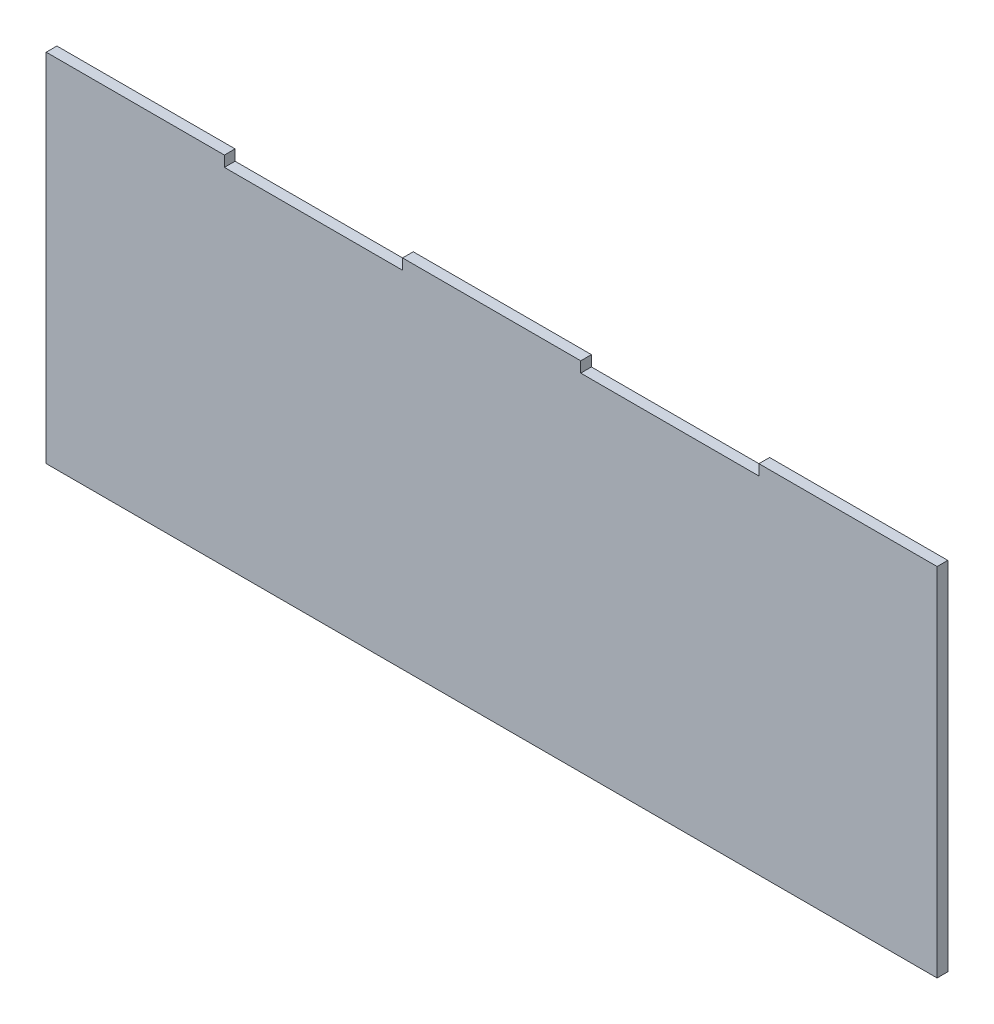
ISO-10303-21;
HEADER;
FILE_DESCRIPTION(('STEP AP214'),'2;1');
FILE_NAME('part.step','',(''),(''),'','','');
FILE_SCHEMA(('AUTOMOTIVE_DESIGN { 1 0 10303 214 1 1 1 1 }'));
ENDSEC;
DATA;
#1=APPLICATION_CONTEXT('core data for automotive mechanical design processes');
#2=APPLICATION_PROTOCOL_DEFINITION('international standard','automotive_design',2000,#1);
#3=PRODUCT_CONTEXT('',#1,'mechanical');
#4=PRODUCT('Part','Part','',(#3));
#5=PRODUCT_RELATED_PRODUCT_CATEGORY('part','',(#4));
#6=PRODUCT_DEFINITION_FORMATION('','',#4);
#7=PRODUCT_DEFINITION_CONTEXT('part definition',#1,'design');
#8=PRODUCT_DEFINITION('design','',#6,#7);
#9=PRODUCT_DEFINITION_SHAPE('','',#8);
#10=(LENGTH_UNIT() NAMED_UNIT(*) SI_UNIT(.MILLI.,.METRE.));
#11=(NAMED_UNIT(*) PLANE_ANGLE_UNIT() SI_UNIT($,.RADIAN.));
#12=(NAMED_UNIT(*) SI_UNIT($,.STERADIAN.) SOLID_ANGLE_UNIT());
#13=UNCERTAINTY_MEASURE_WITH_UNIT(LENGTH_MEASURE(1.E-05),#10,'distance_accuracy_value','');
#14=(GEOMETRIC_REPRESENTATION_CONTEXT(3) GLOBAL_UNCERTAINTY_ASSIGNED_CONTEXT((#13)) GLOBAL_UNIT_ASSIGNED_CONTEXT((#10,
#11,#12)) REPRESENTATION_CONTEXT('',''));
#15=CARTESIAN_POINT('',(0.,0.,0.));
#16=DIRECTION('',(0.,0.,1.));
#17=DIRECTION('',(1.,0.,0.));
#18=AXIS2_PLACEMENT_3D('',#15,#16,#17);
#19=CARTESIAN_POINT('',(5.99315068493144,214.041095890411,6.));
#20=DIRECTION('',(-1.,0.,0.));
#21=DIRECTION('',(0.,-1.,0.));
#22=AXIS2_PLACEMENT_3D('',#19,#20,#21);
#23=PLANE('',#22);
#24=DIRECTION('',(0.,1.,0.));
#25=VECTOR('',#24,1.);
#26=CARTESIAN_POINT('',(5.99315068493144,214.041095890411,0.));
#27=LINE('',#26,#25);
#28=CARTESIAN_POINT('',(5.99315068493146,14.0410958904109,0.));
#29=VERTEX_POINT('',#28);
#30=CARTESIAN_POINT('',(5.99315068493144,214.041095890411,0.));
#31=VERTEX_POINT('',#30);
#32=EDGE_CURVE('E153',#29,#31,#27,.T.);
#33=ORIENTED_EDGE('',*,*,#32,.T.);
#34=DIRECTION('',(0.,0.,-1.));
#35=VECTOR('',#34,1.);
#36=CARTESIAN_POINT('',(5.99315068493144,214.041095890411,6.));
#37=LINE('',#36,#35);
#38=CARTESIAN_POINT('',(5.99315068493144,214.041095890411,6.));
#39=VERTEX_POINT('',#38);
#40=EDGE_CURVE('E11',#39,#31,#37,.T.);
#41=ORIENTED_EDGE('',*,*,#40,.F.);
#42=DIRECTION('',(0.,1.,0.));
#43=VECTOR('',#42,1.);
#44=CARTESIAN_POINT('',(5.99315068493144,214.041095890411,6.));
#45=LINE('',#44,#43);
#46=CARTESIAN_POINT('',(5.99315068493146,14.0410958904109,6.));
#47=VERTEX_POINT('',#46);
#48=EDGE_CURVE('E175',#47,#39,#45,.T.);
#49=ORIENTED_EDGE('',*,*,#48,.F.);
#50=DIRECTION('',(0.,0.,-1.));
#51=VECTOR('',#50,1.);
#52=CARTESIAN_POINT('',(5.99315068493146,14.0410958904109,6.));
#53=LINE('',#52,#51);
#54=EDGE_CURVE('E149',#47,#29,#53,.T.);
#55=ORIENTED_EDGE('',*,*,#54,.T.);
#56=EDGE_LOOP('',(#33,#41,#49,#55));
#57=FACE_BOUND('',#56,.T.);
#58=ADVANCED_FACE('F33',(#57),#23,.F.);
#59=CARTESIAN_POINT('',(-94.0068493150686,214.041095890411,6.));
#60=DIRECTION('',(0.,-1.,0.));
#61=DIRECTION('',(0.,0.,-1.));
#62=AXIS2_PLACEMENT_3D('',#59,#60,#61);
#63=PLANE('',#62);
#64=DIRECTION('',(-1.,0.,0.));
#65=VECTOR('',#64,1.);
#66=CARTESIAN_POINT('',(-94.0068493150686,214.041095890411,0.));
#67=LINE('',#66,#65);
#68=CARTESIAN_POINT('',(-94.0068493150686,214.041095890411,0.));
#69=VERTEX_POINT('',#68);
#70=EDGE_CURVE('E156',#31,#69,#67,.T.);
#71=ORIENTED_EDGE('',*,*,#70,.T.);
#72=DIRECTION('',(0.,0.,-1.));
#73=VECTOR('',#72,1.);
#74=CARTESIAN_POINT('',(-94.0068493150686,214.041095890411,6.));
#75=LINE('',#74,#73);
#76=CARTESIAN_POINT('',(-94.0068493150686,214.041095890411,6.));
#77=VERTEX_POINT('',#76);
#78=EDGE_CURVE('E41',#77,#69,#75,.T.);
#79=ORIENTED_EDGE('',*,*,#78,.F.);
#80=DIRECTION('',(-1.,0.,0.));
#81=VECTOR('',#80,1.);
#82=CARTESIAN_POINT('',(-94.0068493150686,214.041095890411,6.));
#83=LINE('',#82,#81);
#84=EDGE_CURVE('E104',#39,#77,#83,.T.);
#85=ORIENTED_EDGE('',*,*,#84,.F.);
#86=ORIENTED_EDGE('',*,*,#40,.T.);
#87=EDGE_LOOP('',(#71,#79,#85,#86));
#88=FACE_BOUND('',#87,.T.);
#89=ADVANCED_FACE('F253',(#88),#63,.F.);
#90=CARTESIAN_POINT('',(-94.0068493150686,214.041095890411,6.));
#91=DIRECTION('',(1.,0.,0.));
#92=DIRECTION('',(0.,0.,-1.));
#93=AXIS2_PLACEMENT_3D('',#90,#91,#92);
#94=PLANE('',#93);
#95=DIRECTION('',(0.,-1.,0.));
#96=VECTOR('',#95,1.);
#97=CARTESIAN_POINT('',(-94.0068493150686,214.041095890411,0.));
#98=LINE('',#97,#96);
#99=CARTESIAN_POINT('',(-94.0068493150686,208.041095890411,0.));
#100=VERTEX_POINT('',#99);
#101=EDGE_CURVE('E158',#69,#100,#98,.T.);
#102=ORIENTED_EDGE('',*,*,#101,.T.);
#103=DIRECTION('',(0.,0.,-1.));
#104=VECTOR('',#103,1.);
#105=CARTESIAN_POINT('',(-94.0068493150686,208.041095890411,6.));
#106=LINE('',#105,#104);
#107=CARTESIAN_POINT('',(-94.0068493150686,208.041095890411,6.));
#108=VERTEX_POINT('',#107);
#109=EDGE_CURVE('E194',#108,#100,#106,.T.);
#110=ORIENTED_EDGE('',*,*,#109,.F.);
#111=DIRECTION('',(0.,-1.,0.));
#112=VECTOR('',#111,1.);
#113=CARTESIAN_POINT('',(-94.0068493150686,214.041095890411,6.));
#114=LINE('',#113,#112);
#115=EDGE_CURVE('E202',#77,#108,#114,.T.);
#116=ORIENTED_EDGE('',*,*,#115,.F.);
#117=ORIENTED_EDGE('',*,*,#78,.T.);
#118=EDGE_LOOP('',(#102,#110,#116,#117));
#119=FACE_BOUND('',#118,.T.);
#120=ADVANCED_FACE('F200',(#119),#94,.F.);
#121=CARTESIAN_POINT('',(-194.006849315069,208.041095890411,6.));
#122=DIRECTION('',(0.,-1.,0.));
#123=DIRECTION('',(0.,0.,-1.));
#124=AXIS2_PLACEMENT_3D('',#121,#122,#123);
#125=PLANE('',#124);
#126=DIRECTION('',(-1.,0.,0.));
#127=VECTOR('',#126,1.);
#128=CARTESIAN_POINT('',(-194.006849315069,208.041095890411,0.));
#129=LINE('',#128,#127);
#130=CARTESIAN_POINT('',(-194.006849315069,208.041095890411,0.));
#131=VERTEX_POINT('',#130);
#132=EDGE_CURVE('E160',#100,#131,#129,.T.);
#133=ORIENTED_EDGE('',*,*,#132,.T.);
#134=DIRECTION('',(0.,0.,-1.));
#135=VECTOR('',#134,1.);
#136=CARTESIAN_POINT('',(-194.006849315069,208.041095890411,6.));
#137=LINE('',#136,#135);
#138=CARTESIAN_POINT('',(-194.006849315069,208.041095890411,6.));
#139=VERTEX_POINT('',#138);
#140=EDGE_CURVE('E191',#139,#131,#137,.T.);
#141=ORIENTED_EDGE('',*,*,#140,.F.);
#142=DIRECTION('',(-1.,0.,0.));
#143=VECTOR('',#142,1.);
#144=CARTESIAN_POINT('',(-194.006849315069,208.041095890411,6.));
#145=LINE('',#144,#143);
#146=EDGE_CURVE('E220',#108,#139,#145,.T.);
#147=ORIENTED_EDGE('',*,*,#146,.F.);
#148=ORIENTED_EDGE('',*,*,#109,.T.);
#149=EDGE_LOOP('',(#133,#141,#147,#148));
#150=FACE_BOUND('',#149,.T.);
#151=ADVANCED_FACE('F211',(#150),#125,.F.);
#152=CARTESIAN_POINT('',(-194.006849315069,214.041095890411,6.));
#153=DIRECTION('',(-1.,0.,0.));
#154=DIRECTION('',(0.,-1.,0.));
#155=AXIS2_PLACEMENT_3D('',#152,#153,#154);
#156=PLANE('',#155);
#157=DIRECTION('',(0.,1.,0.));
#158=VECTOR('',#157,1.);
#159=CARTESIAN_POINT('',(-194.006849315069,214.041095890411,0.));
#160=LINE('',#159,#158);
#161=CARTESIAN_POINT('',(-194.006849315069,214.041095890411,0.));
#162=VERTEX_POINT('',#161);
#163=EDGE_CURVE('E162',#131,#162,#160,.T.);
#164=ORIENTED_EDGE('',*,*,#163,.T.);
#165=DIRECTION('',(0.,0.,-1.));
#166=VECTOR('',#165,1.);
#167=CARTESIAN_POINT('',(-194.006849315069,214.041095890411,6.));
#168=LINE('',#167,#166);
#169=CARTESIAN_POINT('',(-194.006849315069,214.041095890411,6.));
#170=VERTEX_POINT('',#169);
#171=EDGE_CURVE('E188',#170,#162,#168,.T.);
#172=ORIENTED_EDGE('',*,*,#171,.F.);
#173=DIRECTION('',(0.,1.,0.));
#174=VECTOR('',#173,1.);
#175=CARTESIAN_POINT('',(-194.006849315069,214.041095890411,6.));
#176=LINE('',#175,#174);
#177=EDGE_CURVE('E217',#139,#170,#176,.T.);
#178=ORIENTED_EDGE('',*,*,#177,.F.);
#179=ORIENTED_EDGE('',*,*,#140,.T.);
#180=EDGE_LOOP('',(#164,#172,#178,#179));
#181=FACE_BOUND('',#180,.T.);
#182=ADVANCED_FACE('F215',(#181),#156,.F.);
#183=CARTESIAN_POINT('',(-294.006849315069,214.041095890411,6.));
#184=DIRECTION('',(0.,-1.,0.));
#185=DIRECTION('',(0.,0.,-1.));
#186=AXIS2_PLACEMENT_3D('',#183,#184,#185);
#187=PLANE('',#186);
#188=DIRECTION('',(-1.,0.,0.));
#189=VECTOR('',#188,1.);
#190=CARTESIAN_POINT('',(-294.006849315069,214.041095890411,0.));
#191=LINE('',#190,#189);
#192=CARTESIAN_POINT('',(-294.006849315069,214.041095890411,0.));
#193=VERTEX_POINT('',#192);
#194=EDGE_CURVE('E164',#162,#193,#191,.T.);
#195=ORIENTED_EDGE('',*,*,#194,.T.);
#196=DIRECTION('',(0.,0.,-1.));
#197=VECTOR('',#196,1.);
#198=CARTESIAN_POINT('',(-294.006849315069,214.041095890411,6.));
#199=LINE('',#198,#197);
#200=CARTESIAN_POINT('',(-294.006849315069,214.041095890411,6.));
#201=VERTEX_POINT('',#200);
#202=EDGE_CURVE('E185',#201,#193,#199,.T.);
#203=ORIENTED_EDGE('',*,*,#202,.F.);
#204=DIRECTION('',(-1.,0.,0.));
#205=VECTOR('',#204,1.);
#206=CARTESIAN_POINT('',(-294.006849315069,214.041095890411,6.));
#207=LINE('',#206,#205);
#208=EDGE_CURVE('E219',#170,#201,#207,.T.);
#209=ORIENTED_EDGE('',*,*,#208,.F.);
#210=ORIENTED_EDGE('',*,*,#171,.T.);
#211=EDGE_LOOP('',(#195,#203,#209,#210));
#212=FACE_BOUND('',#211,.T.);
#213=ADVANCED_FACE('F266',(#212),#187,.F.);
#214=CARTESIAN_POINT('',(-294.006849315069,214.041095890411,6.));
#215=DIRECTION('',(1.,0.,0.));
#216=DIRECTION('',(0.,0.,-1.));
#217=AXIS2_PLACEMENT_3D('',#214,#215,#216);
#218=PLANE('',#217);
#219=DIRECTION('',(0.,-1.,0.));
#220=VECTOR('',#219,1.);
#221=CARTESIAN_POINT('',(-294.006849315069,214.041095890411,0.));
#222=LINE('',#221,#220);
#223=CARTESIAN_POINT('',(-294.006849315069,208.041095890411,0.));
#224=VERTEX_POINT('',#223);
#225=EDGE_CURVE('E166',#193,#224,#222,.T.);
#226=ORIENTED_EDGE('',*,*,#225,.T.);
#227=DIRECTION('',(0.,0.,-1.));
#228=VECTOR('',#227,1.);
#229=CARTESIAN_POINT('',(-294.006849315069,208.041095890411,6.));
#230=LINE('',#229,#228);
#231=CARTESIAN_POINT('',(-294.006849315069,208.041095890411,6.));
#232=VERTEX_POINT('',#231);
#233=EDGE_CURVE('E182',#232,#224,#230,.T.);
#234=ORIENTED_EDGE('',*,*,#233,.F.);
#235=DIRECTION('',(0.,-1.,0.));
#236=VECTOR('',#235,1.);
#237=CARTESIAN_POINT('',(-294.006849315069,214.041095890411,6.));
#238=LINE('',#237,#236);
#239=EDGE_CURVE('E222',#201,#232,#238,.T.);
#240=ORIENTED_EDGE('',*,*,#239,.F.);
#241=ORIENTED_EDGE('',*,*,#202,.T.);
#242=EDGE_LOOP('',(#226,#234,#240,#241));
#243=FACE_BOUND('',#242,.T.);
#244=ADVANCED_FACE('F269',(#243),#218,.F.);
#245=CARTESIAN_POINT('',(-394.006849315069,208.041095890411,6.));
#246=DIRECTION('',(0.,-1.,0.));
#247=DIRECTION('',(0.,0.,-1.));
#248=AXIS2_PLACEMENT_3D('',#245,#246,#247);
#249=PLANE('',#248);
#250=DIRECTION('',(-1.,0.,0.));
#251=VECTOR('',#250,1.);
#252=CARTESIAN_POINT('',(-394.006849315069,208.041095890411,0.));
#253=LINE('',#252,#251);
#254=CARTESIAN_POINT('',(-394.006849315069,208.041095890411,0.));
#255=VERTEX_POINT('',#254);
#256=EDGE_CURVE('E168',#224,#255,#253,.T.);
#257=ORIENTED_EDGE('',*,*,#256,.T.);
#258=DIRECTION('',(0.,0.,-1.));
#259=VECTOR('',#258,1.);
#260=CARTESIAN_POINT('',(-394.006849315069,208.041095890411,6.));
#261=LINE('',#260,#259);
#262=CARTESIAN_POINT('',(-394.006849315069,208.041095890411,6.));
#263=VERTEX_POINT('',#262);
#264=EDGE_CURVE('E179',#263,#255,#261,.T.);
#265=ORIENTED_EDGE('',*,*,#264,.F.);
#266=DIRECTION('',(-1.,0.,0.));
#267=VECTOR('',#266,1.);
#268=CARTESIAN_POINT('',(-394.006849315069,208.041095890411,6.));
#269=LINE('',#268,#267);
#270=EDGE_CURVE('E228',#232,#263,#269,.T.);
#271=ORIENTED_EDGE('',*,*,#270,.F.);
#272=ORIENTED_EDGE('',*,*,#233,.T.);
#273=EDGE_LOOP('',(#257,#265,#271,#272));
#274=FACE_BOUND('',#273,.T.);
#275=ADVANCED_FACE('F234',(#274),#249,.F.);
#276=CARTESIAN_POINT('',(-394.006849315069,214.041095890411,6.));
#277=DIRECTION('',(-1.,0.,0.));
#278=DIRECTION('',(0.,0.,1.));
#279=AXIS2_PLACEMENT_3D('',#276,#277,#278);
#280=PLANE('',#279);
#281=DIRECTION('',(0.,1.,0.));
#282=VECTOR('',#281,1.);
#283=CARTESIAN_POINT('',(-394.006849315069,214.041095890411,0.));
#284=LINE('',#283,#282);
#285=CARTESIAN_POINT('',(-394.006849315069,214.041095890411,0.));
#286=VERTEX_POINT('',#285);
#287=EDGE_CURVE('E170',#255,#286,#284,.T.);
#288=ORIENTED_EDGE('',*,*,#287,.T.);
#289=DIRECTION('',(0.,0.,-1.));
#290=VECTOR('',#289,1.);
#291=CARTESIAN_POINT('',(-394.006849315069,214.041095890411,6.));
#292=LINE('',#291,#290);
#293=CARTESIAN_POINT('',(-394.006849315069,214.041095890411,6.));
#294=VERTEX_POINT('',#293);
#295=EDGE_CURVE('E144',#294,#286,#292,.T.);
#296=ORIENTED_EDGE('',*,*,#295,.F.);
#297=DIRECTION('',(0.,1.,0.));
#298=VECTOR('',#297,1.);
#299=CARTESIAN_POINT('',(-394.006849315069,214.041095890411,6.));
#300=LINE('',#299,#298);
#301=EDGE_CURVE('E135',#263,#294,#300,.T.);
#302=ORIENTED_EDGE('',*,*,#301,.F.);
#303=ORIENTED_EDGE('',*,*,#264,.T.);
#304=EDGE_LOOP('',(#288,#296,#302,#303));
#305=FACE_BOUND('',#304,.T.);
#306=ADVANCED_FACE('F238',(#305),#280,.F.);
#307=CARTESIAN_POINT('',(-494.006849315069,214.041095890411,6.));
#308=DIRECTION('',(0.,-1.,0.));
#309=DIRECTION('',(0.,0.,-1.));
#310=AXIS2_PLACEMENT_3D('',#307,#308,#309);
#311=PLANE('',#310);
#312=DIRECTION('',(-1.,0.,0.));
#313=VECTOR('',#312,1.);
#314=CARTESIAN_POINT('',(-494.006849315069,214.041095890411,0.));
#315=LINE('',#314,#313);
#316=CARTESIAN_POINT('',(-494.006849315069,214.041095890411,0.));
#317=VERTEX_POINT('',#316);
#318=EDGE_CURVE('E143',#286,#317,#315,.T.);
#319=ORIENTED_EDGE('',*,*,#318,.T.);
#320=DIRECTION('',(0.,0.,-1.));
#321=VECTOR('',#320,1.);
#322=CARTESIAN_POINT('',(-494.006849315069,214.041095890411,6.));
#323=LINE('',#322,#321);
#324=CARTESIAN_POINT('',(-494.006849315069,214.041095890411,6.));
#325=VERTEX_POINT('',#324);
#326=EDGE_CURVE('E140',#325,#317,#323,.T.);
#327=ORIENTED_EDGE('',*,*,#326,.F.);
#328=DIRECTION('',(-1.,0.,0.));
#329=VECTOR('',#328,1.);
#330=CARTESIAN_POINT('',(-494.006849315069,214.041095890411,6.));
#331=LINE('',#330,#329);
#332=EDGE_CURVE('E129',#294,#325,#331,.T.);
#333=ORIENTED_EDGE('',*,*,#332,.F.);
#334=ORIENTED_EDGE('',*,*,#295,.T.);
#335=EDGE_LOOP('',(#319,#327,#333,#334));
#336=FACE_BOUND('',#335,.T.);
#337=ADVANCED_FACE('F141',(#336),#311,.F.);
#338=CARTESIAN_POINT('',(-494.006849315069,214.041095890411,6.));
#339=DIRECTION('',(1.,0.,0.));
#340=DIRECTION('',(0.,0.,-1.));
#341=AXIS2_PLACEMENT_3D('',#338,#339,#340);
#342=PLANE('',#341);
#343=DIRECTION('',(0.,-1.,0.));
#344=VECTOR('',#343,1.);
#345=CARTESIAN_POINT('',(-494.006849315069,214.041095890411,0.));
#346=LINE('',#345,#344);
#347=CARTESIAN_POINT('',(-494.006849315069,14.0410958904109,0.));
#348=VERTEX_POINT('',#347);
#349=EDGE_CURVE('E90',#317,#348,#346,.T.);
#350=ORIENTED_EDGE('',*,*,#349,.T.);
#351=DIRECTION('',(0.,0.,-1.));
#352=VECTOR('',#351,1.);
#353=CARTESIAN_POINT('',(-494.006849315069,14.0410958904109,6.));
#354=LINE('',#353,#352);
#355=CARTESIAN_POINT('',(-494.006849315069,14.0410958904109,6.));
#356=VERTEX_POINT('',#355);
#357=EDGE_CURVE('E145',#356,#348,#354,.T.);
#358=ORIENTED_EDGE('',*,*,#357,.F.);
#359=DIRECTION('',(0.,-1.,0.));
#360=VECTOR('',#359,1.);
#361=CARTESIAN_POINT('',(-494.006849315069,214.041095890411,6.));
#362=LINE('',#361,#360);
#363=EDGE_CURVE('E133',#325,#356,#362,.T.);
#364=ORIENTED_EDGE('',*,*,#363,.F.);
#365=ORIENTED_EDGE('',*,*,#326,.T.);
#366=EDGE_LOOP('',(#350,#358,#364,#365));
#367=FACE_BOUND('',#366,.T.);
#368=ADVANCED_FACE('F147',(#367),#342,.F.);
#369=CARTESIAN_POINT('',(-494.006849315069,14.0410958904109,6.));
#370=DIRECTION('',(0.,1.,0.));
#371=DIRECTION('',(0.,0.,1.));
#372=AXIS2_PLACEMENT_3D('',#369,#370,#371);
#373=PLANE('',#372);
#374=DIRECTION('',(1.,0.,0.));
#375=VECTOR('',#374,1.);
#376=CARTESIAN_POINT('',(-494.006849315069,14.0410958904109,0.));
#377=LINE('',#376,#375);
#378=EDGE_CURVE('E96',#348,#29,#377,.T.);
#379=ORIENTED_EDGE('',*,*,#378,.T.);
#380=ORIENTED_EDGE('',*,*,#54,.F.);
#381=DIRECTION('',(1.,0.,0.));
#382=VECTOR('',#381,1.);
#383=CARTESIAN_POINT('',(-494.006849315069,14.0410958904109,6.));
#384=LINE('',#383,#382);
#385=EDGE_CURVE('E49',#356,#47,#384,.T.);
#386=ORIENTED_EDGE('',*,*,#385,.F.);
#387=ORIENTED_EDGE('',*,*,#357,.T.);
#388=EDGE_LOOP('',(#379,#380,#386,#387));
#389=FACE_BOUND('',#388,.T.);
#390=ADVANCED_FACE('F242',(#389),#373,.F.);
#391=CARTESIAN_POINT('',(0.,0.,6.));
#392=DIRECTION('',(0.,0.,1.));
#393=DIRECTION('',(1.,0.,0.));
#394=AXIS2_PLACEMENT_3D('',#391,#392,#393);
#395=PLANE('',#394);
#396=ORIENTED_EDGE('',*,*,#48,.T.);
#397=ORIENTED_EDGE('',*,*,#84,.T.);
#398=ORIENTED_EDGE('',*,*,#115,.T.);
#399=ORIENTED_EDGE('',*,*,#146,.T.);
#400=ORIENTED_EDGE('',*,*,#177,.T.);
#401=ORIENTED_EDGE('',*,*,#208,.T.);
#402=ORIENTED_EDGE('',*,*,#239,.T.);
#403=ORIENTED_EDGE('',*,*,#270,.T.);
#404=ORIENTED_EDGE('',*,*,#301,.T.);
#405=ORIENTED_EDGE('',*,*,#332,.T.);
#406=ORIENTED_EDGE('',*,*,#363,.T.);
#407=ORIENTED_EDGE('',*,*,#385,.T.);
#408=EDGE_LOOP('',(#396,#397,#398,#399,#400,#401,#402,#403,#404,#405,#406,#407));
#409=FACE_BOUND('',#408,.T.);
#410=ADVANCED_FACE('F131',(#409),#395,.T.);
#411=CARTESIAN_POINT('',(0.,0.,0.));
#412=DIRECTION('',(0.,0.,1.));
#413=DIRECTION('',(1.,0.,0.));
#414=AXIS2_PLACEMENT_3D('',#411,#412,#413);
#415=PLANE('',#414);
#416=ORIENTED_EDGE('',*,*,#32,.F.);
#417=ORIENTED_EDGE('',*,*,#378,.F.);
#418=ORIENTED_EDGE('',*,*,#349,.F.);
#419=ORIENTED_EDGE('',*,*,#318,.F.);
#420=ORIENTED_EDGE('',*,*,#287,.F.);
#421=ORIENTED_EDGE('',*,*,#256,.F.);
#422=ORIENTED_EDGE('',*,*,#225,.F.);
#423=ORIENTED_EDGE('',*,*,#194,.F.);
#424=ORIENTED_EDGE('',*,*,#163,.F.);
#425=ORIENTED_EDGE('',*,*,#132,.F.);
#426=ORIENTED_EDGE('',*,*,#101,.F.);
#427=ORIENTED_EDGE('',*,*,#70,.F.);
#428=EDGE_LOOP('',(#416,#417,#418,#419,#420,#421,#422,#423,#424,#425,#426,#427));
#429=FACE_BOUND('',#428,.T.);
#430=ADVANCED_FACE('F206',(#429),#415,.F.);
#431=CLOSED_SHELL('',(#58,#89,#120,#151,#182,#213,#244,#275,#306,#337,#368,#390,#410,#430));
#432=MANIFOLD_SOLID_BREP('B2',#431);
#433=ADVANCED_BREP_SHAPE_REPRESENTATION('',(#18,#432),#14);
#434=SHAPE_DEFINITION_REPRESENTATION(#9,#433);
ENDSEC;
END-ISO-10303-21;
